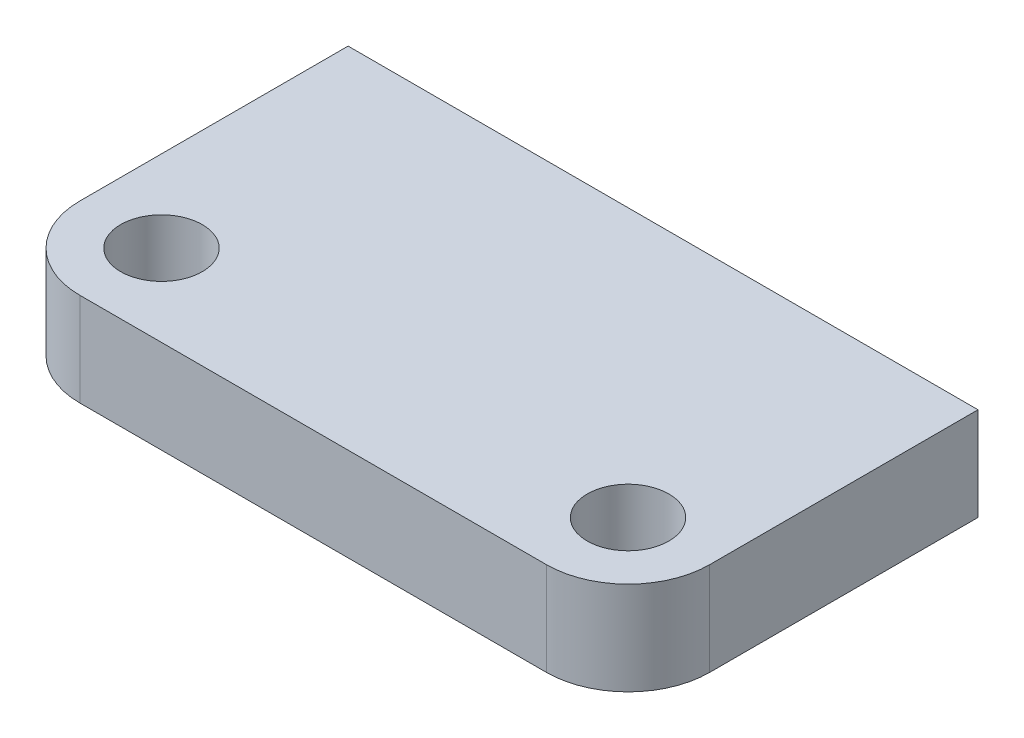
from build123d import *

# Parameters (mm, degrees)
SKETCH_1_R      = 3.5
EXTRUDE_1_DEPTH = 8


with BuildPart() as part:
    # Sketch 1 → Extrude 1 (new body)
    with BuildSketch(Plane(origin=(0, 0, 0), x_dir=(1, 0, 0), z_dir=(0, 1, 0))):
        with BuildLine():
            Line((27, 0), (-27, 0))
            Line((-27, 0), (-27, -23))
            ThreePointArc((-27, -23), (-24.949747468, -27.949747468), (-20, -30))
            Line((-20, -30), (20, -30))
            ThreePointArc((20, -30), (24.949747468, -27.949747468), (27, -23))
            Line((27, -23), (27, 0))
        make_face()
        with Locations(Location((-20, -23, 0), (0, 0, 270))):
            Circle(SKETCH_1_R, mode=Mode.SUBTRACT)
        with Locations(Location((20, -23, 0), (0, 0, 90))):
            Circle(SKETCH_1_R, mode=Mode.SUBTRACT)
    extrude(amount=EXTRUDE_1_DEPTH)


solid = part.part
